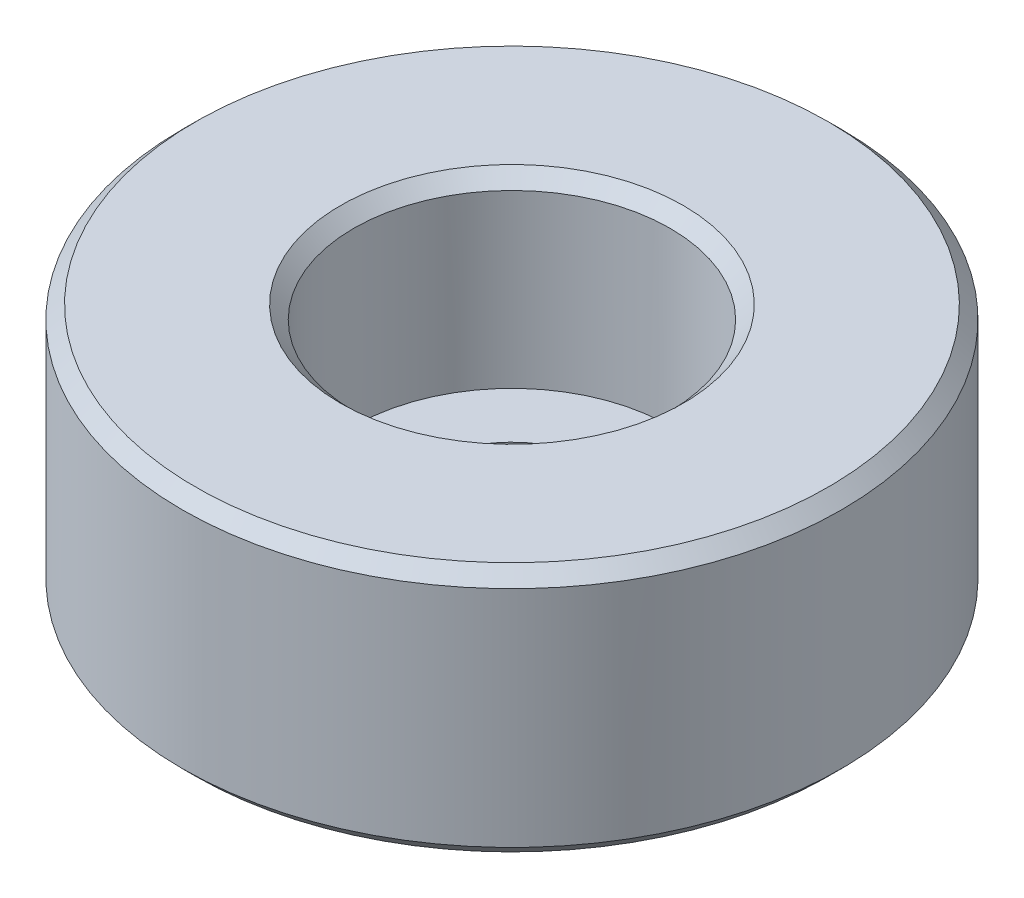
ISO-10303-21;
HEADER;
FILE_DESCRIPTION(('STEP AP214'),'2;1');
FILE_NAME('part.step','',(''),(''),'','','');
FILE_SCHEMA(('AUTOMOTIVE_DESIGN { 1 0 10303 214 1 1 1 1 }'));
ENDSEC;
DATA;
#1=APPLICATION_CONTEXT('core data for automotive mechanical design processes');
#2=APPLICATION_PROTOCOL_DEFINITION('international standard','automotive_design',2000,#1);
#3=PRODUCT_CONTEXT('',#1,'mechanical');
#4=PRODUCT('Part','Part','',(#3));
#5=PRODUCT_RELATED_PRODUCT_CATEGORY('part','',(#4));
#6=PRODUCT_DEFINITION_FORMATION('','',#4);
#7=PRODUCT_DEFINITION_CONTEXT('part definition',#1,'design');
#8=PRODUCT_DEFINITION('design','',#6,#7);
#9=PRODUCT_DEFINITION_SHAPE('','',#8);
#10=(LENGTH_UNIT() NAMED_UNIT(*) SI_UNIT(.MILLI.,.METRE.));
#11=(NAMED_UNIT(*) PLANE_ANGLE_UNIT() SI_UNIT($,.RADIAN.));
#12=(NAMED_UNIT(*) SI_UNIT($,.STERADIAN.) SOLID_ANGLE_UNIT());
#13=UNCERTAINTY_MEASURE_WITH_UNIT(LENGTH_MEASURE(1.E-05),#10,'distance_accuracy_value','');
#14=(GEOMETRIC_REPRESENTATION_CONTEXT(3) GLOBAL_UNCERTAINTY_ASSIGNED_CONTEXT((#13)) GLOBAL_UNIT_ASSIGNED_CONTEXT((#10,
#11,#12)) REPRESENTATION_CONTEXT('',''));
#15=CARTESIAN_POINT('',(0.,0.,0.));
#16=DIRECTION('',(0.,0.,1.));
#17=DIRECTION('',(1.,0.,0.));
#18=AXIS2_PLACEMENT_3D('',#15,#16,#17);
#19=CARTESIAN_POINT('',(3.50000000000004,-4.,0.));
#20=DIRECTION('',(0.,1.,0.));
#21=DIRECTION('',(0.,0.,1.));
#22=AXIS2_PLACEMENT_3D('',#19,#20,#21);
#23=PLANE('',#22);
#24=CARTESIAN_POINT('',(0.,-4.,0.));
#25=DIRECTION('',(0.,1.,0.));
#26=DIRECTION('',(0.,0.,1.));
#27=AXIS2_PLACEMENT_3D('',#24,#25,#26);
#28=CIRCLE('',#27,5.50000000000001);
#29=CARTESIAN_POINT('',(0.,-4.,5.50000000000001));
#30=VERTEX_POINT('',#29);
#31=EDGE_CURVE('E33',#30,#30,#28,.F.);
#32=ORIENTED_EDGE('',*,*,#31,.T.);
#33=EDGE_LOOP('',(#32));
#34=FACE_BOUND('',#33,.T.);
#35=CARTESIAN_POINT('',(0.,-4.,0.));
#36=DIRECTION('',(0.,1.,0.));
#37=DIRECTION('',(0.,0.,1.));
#38=AXIS2_PLACEMENT_3D('',#35,#36,#37);
#39=CIRCLE('',#38,4.00000000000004);
#40=CARTESIAN_POINT('',(0.,-4.,4.00000000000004));
#41=VERTEX_POINT('',#40);
#42=EDGE_CURVE('E37',#41,#41,#39,.T.);
#43=ORIENTED_EDGE('',*,*,#42,.T.);
#44=EDGE_LOOP('',(#43));
#45=FACE_BOUND('',#44,.T.);
#46=ADVANCED_FACE('F27',(#34,#45),#23,.F.);
#47=CARTESIAN_POINT('',(0.,50.,0.));
#48=DIRECTION('',(0.,1.,0.));
#49=DIRECTION('',(0.,0.,1.));
#50=AXIS2_PLACEMENT_3D('',#47,#48,#49);
#51=CYLINDRICAL_SURFACE('',#50,6.00000000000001);
#52=CARTESIAN_POINT('',(0.,-3.49999999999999,0.));
#53=DIRECTION('',(0.,1.,0.));
#54=DIRECTION('',(0.,0.,1.));
#55=AXIS2_PLACEMENT_3D('',#52,#53,#54);
#56=CIRCLE('',#55,6.00000000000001);
#57=CARTESIAN_POINT('',(0.,-3.49999999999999,6.00000000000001));
#58=VERTEX_POINT('',#57);
#59=EDGE_CURVE('E41',#58,#58,#56,.T.);
#60=ORIENTED_EDGE('',*,*,#59,.T.);
#61=EDGE_LOOP('',(#60));
#62=FACE_BOUND('',#61,.T.);
#63=CARTESIAN_POINT('',(0.,0.,0.));
#64=DIRECTION('',(0.,1.,0.));
#65=DIRECTION('',(0.,0.,1.));
#66=AXIS2_PLACEMENT_3D('',#63,#64,#65);
#67=CIRCLE('',#66,6.00000000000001);
#68=CARTESIAN_POINT('',(0.,0.,6.00000000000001));
#69=VERTEX_POINT('',#68);
#70=EDGE_CURVE('E64',#69,#69,#67,.T.);
#71=ORIENTED_EDGE('',*,*,#70,.F.);
#72=EDGE_LOOP('',(#71));
#73=FACE_BOUND('',#72,.T.);
#74=ADVANCED_FACE('F94',(#62,#73),#51,.T.);
#75=CARTESIAN_POINT('',(6.00000000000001,0.,0.));
#76=DIRECTION('',(0.,1.,0.));
#77=DIRECTION('',(0.,0.,1.));
#78=AXIS2_PLACEMENT_3D('',#75,#76,#77);
#79=PLANE('',#78);
#80=CARTESIAN_POINT('',(0.,0.,0.));
#81=DIRECTION('',(0.,1.,0.));
#82=DIRECTION('',(0.,0.,1.));
#83=AXIS2_PLACEMENT_3D('',#80,#81,#82);
#84=CIRCLE('',#83,12.);
#85=CARTESIAN_POINT('',(0.,0.,12.));
#86=VERTEX_POINT('',#85);
#87=EDGE_CURVE('E46',#86,#86,#84,.F.);
#88=ORIENTED_EDGE('',*,*,#87,.T.);
#89=EDGE_LOOP('',(#88));
#90=FACE_BOUND('',#89,.T.);
#91=ORIENTED_EDGE('',*,*,#70,.T.);
#92=EDGE_LOOP('',(#91));
#93=FACE_BOUND('',#92,.T.);
#94=ADVANCED_FACE('F98',(#90,#93),#79,.F.);
#95=CARTESIAN_POINT('',(0.,50.,0.));
#96=DIRECTION('',(0.,1.,0.));
#97=DIRECTION('',(0.,0.,1.));
#98=AXIS2_PLACEMENT_3D('',#95,#96,#97);
#99=CYLINDRICAL_SURFACE('',#98,12.5);
#100=CARTESIAN_POINT('',(0.,8.99999999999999,0.));
#101=DIRECTION('',(0.,-1.,0.));
#102=DIRECTION('',(0.,0.,-1.));
#103=AXIS2_PLACEMENT_3D('',#100,#101,#102);
#104=CIRCLE('',#103,12.5);
#105=CARTESIAN_POINT('',(0.,8.99999999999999,-12.5));
#106=VERTEX_POINT('',#105);
#107=EDGE_CURVE('E52',#106,#106,#104,.T.);
#108=ORIENTED_EDGE('',*,*,#107,.T.);
#109=EDGE_LOOP('',(#108));
#110=FACE_BOUND('',#109,.T.);
#111=CARTESIAN_POINT('',(0.,0.499999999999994,0.));
#112=DIRECTION('',(0.,1.,0.));
#113=DIRECTION('',(0.,0.,1.));
#114=AXIS2_PLACEMENT_3D('',#111,#112,#113);
#115=CIRCLE('',#114,12.5);
#116=CARTESIAN_POINT('',(0.,0.499999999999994,12.5));
#117=VERTEX_POINT('',#116);
#118=EDGE_CURVE('E55',#117,#117,#115,.T.);
#119=ORIENTED_EDGE('',*,*,#118,.T.);
#120=EDGE_LOOP('',(#119));
#121=FACE_BOUND('',#120,.T.);
#122=ADVANCED_FACE('F90',(#110,#121),#99,.T.);
#123=CARTESIAN_POINT('',(12.5,9.5,0.));
#124=DIRECTION('',(0.,-1.,0.));
#125=DIRECTION('',(0.,0.,-1.));
#126=AXIS2_PLACEMENT_3D('',#123,#124,#125);
#127=PLANE('',#126);
#128=CARTESIAN_POINT('',(0.,9.5,0.));
#129=DIRECTION('',(0.,-1.,0.));
#130=DIRECTION('',(0.,0.,-1.));
#131=AXIS2_PLACEMENT_3D('',#128,#129,#130);
#132=CIRCLE('',#131,12.);
#133=CARTESIAN_POINT('',(0.,9.5,-12.));
#134=VERTEX_POINT('',#133);
#135=EDGE_CURVE('E58',#134,#134,#132,.F.);
#136=ORIENTED_EDGE('',*,*,#135,.T.);
#137=EDGE_LOOP('',(#136));
#138=FACE_BOUND('',#137,.T.);
#139=CARTESIAN_POINT('',(0.,9.5,0.));
#140=DIRECTION('',(0.,-1.,0.));
#141=DIRECTION('',(0.,0.,-1.));
#142=AXIS2_PLACEMENT_3D('',#139,#140,#141);
#143=CIRCLE('',#142,6.50000000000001);
#144=CARTESIAN_POINT('',(0.,9.5,-6.50000000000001));
#145=VERTEX_POINT('',#144);
#146=EDGE_CURVE('E61',#145,#145,#143,.T.);
#147=ORIENTED_EDGE('',*,*,#146,.T.);
#148=EDGE_LOOP('',(#147));
#149=FACE_BOUND('',#148,.T.);
#150=ADVANCED_FACE('F84',(#138,#149),#127,.F.);
#151=CARTESIAN_POINT('',(0.,50.,0.));
#152=DIRECTION('',(0.,1.,0.));
#153=DIRECTION('',(0.,0.,1.));
#154=AXIS2_PLACEMENT_3D('',#151,#152,#153);
#155=CYLINDRICAL_SURFACE('',#154,6.00000000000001);
#156=CARTESIAN_POINT('',(0.,8.99999999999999,0.));
#157=DIRECTION('',(0.,-1.,0.));
#158=DIRECTION('',(0.,0.,-1.));
#159=AXIS2_PLACEMENT_3D('',#156,#157,#158);
#160=CIRCLE('',#159,6.00000000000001);
#161=CARTESIAN_POINT('',(0.,8.99999999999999,-6.00000000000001));
#162=VERTEX_POINT('',#161);
#163=EDGE_CURVE('E49',#162,#162,#160,.F.);
#164=ORIENTED_EDGE('',*,*,#163,.T.);
#165=EDGE_LOOP('',(#164));
#166=FACE_BOUND('',#165,.T.);
#167=CARTESIAN_POINT('',(0.,2.5,0.));
#168=DIRECTION('',(0.,1.,0.));
#169=DIRECTION('',(0.,0.,1.));
#170=AXIS2_PLACEMENT_3D('',#167,#168,#169);
#171=CIRCLE('',#170,6.00000000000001);
#172=CARTESIAN_POINT('',(0.,2.5,6.00000000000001));
#173=VERTEX_POINT('',#172);
#174=EDGE_CURVE('E67',#173,#173,#171,.T.);
#175=ORIENTED_EDGE('',*,*,#174,.F.);
#176=EDGE_LOOP('',(#175));
#177=FACE_BOUND('',#176,.T.);
#178=ADVANCED_FACE('F79',(#166,#177),#155,.F.);
#179=CARTESIAN_POINT('',(3.50000000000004,2.5,0.));
#180=DIRECTION('',(0.,-1.,0.));
#181=DIRECTION('',(0.,0.,-1.));
#182=AXIS2_PLACEMENT_3D('',#179,#180,#181);
#183=PLANE('',#182);
#184=CARTESIAN_POINT('',(0.,2.5,0.));
#185=DIRECTION('',(0.,1.,0.));
#186=DIRECTION('',(0.,0.,1.));
#187=AXIS2_PLACEMENT_3D('',#184,#185,#186);
#188=CIRCLE('',#187,3.50000000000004);
#189=CARTESIAN_POINT('',(0.,2.5,3.50000000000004));
#190=VERTEX_POINT('',#189);
#191=EDGE_CURVE('E70',#190,#190,#188,.T.);
#192=ORIENTED_EDGE('',*,*,#191,.F.);
#193=EDGE_LOOP('',(#192));
#194=FACE_BOUND('',#193,.T.);
#195=ORIENTED_EDGE('',*,*,#174,.T.);
#196=EDGE_LOOP('',(#195));
#197=FACE_BOUND('',#196,.T.);
#198=ADVANCED_FACE('F76',(#194,#197),#183,.F.);
#199=CARTESIAN_POINT('',(0.,50.,0.));
#200=DIRECTION('',(0.,1.,0.));
#201=DIRECTION('',(0.,0.,1.));
#202=AXIS2_PLACEMENT_3D('',#199,#200,#201);
#203=CYLINDRICAL_SURFACE('',#202,3.50000000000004);
#204=CARTESIAN_POINT('',(0.,-3.5,0.));
#205=DIRECTION('',(0.,1.,0.));
#206=DIRECTION('',(0.,0.,1.));
#207=AXIS2_PLACEMENT_3D('',#204,#205,#206);
#208=CIRCLE('',#207,3.50000000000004);
#209=CARTESIAN_POINT('',(0.,-3.5,3.50000000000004));
#210=VERTEX_POINT('',#209);
#211=EDGE_CURVE('E10',#210,#210,#208,.F.);
#212=ORIENTED_EDGE('',*,*,#211,.T.);
#213=EDGE_LOOP('',(#212));
#214=FACE_BOUND('',#213,.T.);
#215=ORIENTED_EDGE('',*,*,#191,.T.);
#216=EDGE_LOOP('',(#215));
#217=FACE_BOUND('',#216,.T.);
#218=ADVANCED_FACE('F74',(#214,#217),#203,.F.);
#219=CARTESIAN_POINT('',(0.,9.5,0.));
#220=DIRECTION('',(0.,-1.,0.));
#221=DIRECTION('',(0.,0.,-1.));
#222=AXIS2_PLACEMENT_3D('',#219,#220,#221);
#223=CONICAL_SURFACE('',#222,12.,0.78539816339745);
#224=ORIENTED_EDGE('',*,*,#107,.F.);
#225=EDGE_LOOP('',(#224));
#226=FACE_BOUND('',#225,.T.);
#227=ORIENTED_EDGE('',*,*,#135,.F.);
#228=EDGE_LOOP('',(#227));
#229=FACE_BOUND('',#228,.T.);
#230=ADVANCED_FACE('F121',(#226,#229),#223,.T.);
#231=CARTESIAN_POINT('',(0.,8.99999999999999,0.));
#232=DIRECTION('',(0.,1.,0.));
#233=DIRECTION('',(0.,0.,1.));
#234=AXIS2_PLACEMENT_3D('',#231,#232,#233);
#235=CONICAL_SURFACE('',#234,6.00000000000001,0.785398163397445);
#236=ORIENTED_EDGE('',*,*,#146,.F.);
#237=EDGE_LOOP('',(#236));
#238=FACE_BOUND('',#237,.T.);
#239=ORIENTED_EDGE('',*,*,#163,.F.);
#240=EDGE_LOOP('',(#239));
#241=FACE_BOUND('',#240,.T.);
#242=ADVANCED_FACE('F117',(#238,#241),#235,.F.);
#243=CARTESIAN_POINT('',(0.,0.499999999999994,0.));
#244=DIRECTION('',(0.,1.,0.));
#245=DIRECTION('',(0.,0.,1.));
#246=AXIS2_PLACEMENT_3D('',#243,#244,#245);
#247=CONICAL_SURFACE('',#246,12.5,0.785398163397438);
#248=ORIENTED_EDGE('',*,*,#87,.F.);
#249=EDGE_LOOP('',(#248));
#250=FACE_BOUND('',#249,.T.);
#251=ORIENTED_EDGE('',*,*,#118,.F.);
#252=EDGE_LOOP('',(#251));
#253=FACE_BOUND('',#252,.T.);
#254=ADVANCED_FACE('F111',(#250,#253),#247,.T.);
#255=CARTESIAN_POINT('',(0.,-3.49999999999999,0.));
#256=DIRECTION('',(0.,1.,0.));
#257=DIRECTION('',(0.,0.,1.));
#258=AXIS2_PLACEMENT_3D('',#255,#256,#257);
#259=CONICAL_SURFACE('',#258,6.00000000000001,0.785398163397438);
#260=ORIENTED_EDGE('',*,*,#31,.F.);
#261=EDGE_LOOP('',(#260));
#262=FACE_BOUND('',#261,.T.);
#263=ORIENTED_EDGE('',*,*,#59,.F.);
#264=EDGE_LOOP('',(#263));
#265=FACE_BOUND('',#264,.T.);
#266=ADVANCED_FACE('F105',(#262,#265),#259,.T.);
#267=CARTESIAN_POINT('',(0.,-4.,0.));
#268=DIRECTION('',(0.,-1.,0.));
#269=DIRECTION('',(0.,0.,-1.));
#270=AXIS2_PLACEMENT_3D('',#267,#268,#269);
#271=CONICAL_SURFACE('',#270,4.00000000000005,0.78539816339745);
#272=ORIENTED_EDGE('',*,*,#211,.F.);
#273=EDGE_LOOP('',(#272));
#274=FACE_BOUND('',#273,.T.);
#275=ORIENTED_EDGE('',*,*,#42,.F.);
#276=EDGE_LOOP('',(#275));
#277=FACE_BOUND('',#276,.T.);
#278=ADVANCED_FACE('F103',(#274,#277),#271,.F.);
#279=CLOSED_SHELL('',(#46,#74,#94,#122,#150,#178,#198,#218,#230,#242,#254,#266,#278));
#280=MANIFOLD_SOLID_BREP('B2',#279);
#281=ADVANCED_BREP_SHAPE_REPRESENTATION('',(#18,#280),#14);
#282=SHAPE_DEFINITION_REPRESENTATION(#9,#281);
ENDSEC;
END-ISO-10303-21;
